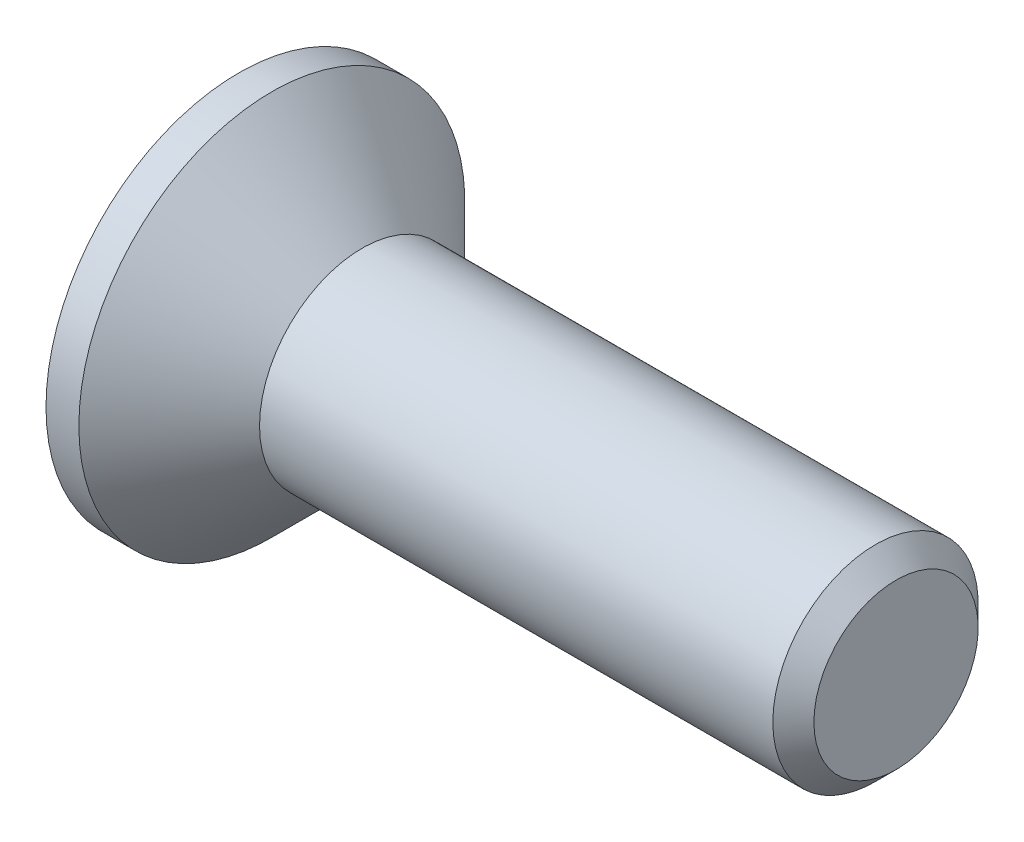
ISO-10303-21;
HEADER;
FILE_DESCRIPTION(('STEP AP214'),'2;1');
FILE_NAME('part.step','',(''),(''),'','','');
FILE_SCHEMA(('AUTOMOTIVE_DESIGN { 1 0 10303 214 1 1 1 1 }'));
ENDSEC;
DATA;
#1=APPLICATION_CONTEXT('core data for automotive mechanical design processes');
#2=APPLICATION_PROTOCOL_DEFINITION('international standard','automotive_design',2000,#1);
#3=PRODUCT_CONTEXT('',#1,'mechanical');
#4=PRODUCT('Part','Part','',(#3));
#5=PRODUCT_RELATED_PRODUCT_CATEGORY('part','',(#4));
#6=PRODUCT_DEFINITION_FORMATION('','',#4);
#7=PRODUCT_DEFINITION_CONTEXT('part definition',#1,'design');
#8=PRODUCT_DEFINITION('design','',#6,#7);
#9=PRODUCT_DEFINITION_SHAPE('','',#8);
#10=(LENGTH_UNIT() NAMED_UNIT(*) SI_UNIT(.MILLI.,.METRE.));
#11=(NAMED_UNIT(*) PLANE_ANGLE_UNIT() SI_UNIT($,.RADIAN.));
#12=(NAMED_UNIT(*) SI_UNIT($,.STERADIAN.) SOLID_ANGLE_UNIT());
#13=UNCERTAINTY_MEASURE_WITH_UNIT(LENGTH_MEASURE(1.E-05),#10,'distance_accuracy_value','');
#14=(GEOMETRIC_REPRESENTATION_CONTEXT(3) GLOBAL_UNCERTAINTY_ASSIGNED_CONTEXT((#13)) GLOBAL_UNIT_ASSIGNED_CONTEXT((#10,
#11,#12)) REPRESENTATION_CONTEXT('',''));
#15=CARTESIAN_POINT('',(0.,0.,0.));
#16=DIRECTION('',(0.,0.,1.));
#17=DIRECTION('',(1.,0.,0.));
#18=AXIS2_PLACEMENT_3D('',#15,#16,#17);
#19=CARTESIAN_POINT('',(0.,0.,0.));
#20=DIRECTION('',(-1.,0.,0.));
#21=DIRECTION('',(0.,0.,1.));
#22=AXIS2_PLACEMENT_3D('',#19,#20,#21);
#23=CONICAL_SURFACE('',#22,1.25,0.78539816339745);
#24=CARTESIAN_POINT('',(-1.1,0.,0.));
#25=DIRECTION('',(-1.,0.,0.));
#26=DIRECTION('',(0.,0.,1.));
#27=AXIS2_PLACEMENT_3D('',#24,#25,#26);
#28=CIRCLE('',#27,2.35);
#29=CARTESIAN_POINT('',(-1.1,0.,2.35));
#30=VERTEX_POINT('',#29);
#31=EDGE_CURVE('E189',#30,#30,#28,.T.);
#32=ORIENTED_EDGE('',*,*,#31,.F.);
#33=EDGE_LOOP('',(#32));
#34=FACE_BOUND('',#33,.T.);
#35=CARTESIAN_POINT('',(0.,0.,0.));
#36=DIRECTION('',(-1.,0.,0.));
#37=DIRECTION('',(0.,0.,1.));
#38=AXIS2_PLACEMENT_3D('',#35,#36,#37);
#39=CIRCLE('',#38,1.25);
#40=CARTESIAN_POINT('',(0.,0.,1.25));
#41=VERTEX_POINT('',#40);
#42=EDGE_CURVE('E212',#41,#41,#39,.T.);
#43=ORIENTED_EDGE('',*,*,#42,.T.);
#44=EDGE_LOOP('',(#43));
#45=FACE_BOUND('',#44,.T.);
#46=ADVANCED_FACE('F33',(#34,#45),#23,.T.);
#47=CARTESIAN_POINT('',(-1.5,0.,0.));
#48=DIRECTION('',(-1.,0.,0.));
#49=DIRECTION('',(0.,0.,1.));
#50=AXIS2_PLACEMENT_3D('',#47,#48,#49);
#51=CYLINDRICAL_SURFACE('',#50,1.25);
#52=CARTESIAN_POINT('',(6.25,0.,0.));
#53=DIRECTION('',(-1.,0.,0.));
#54=DIRECTION('',(0.,0.,1.));
#55=AXIS2_PLACEMENT_3D('',#52,#53,#54);
#56=CIRCLE('',#55,1.25);
#57=CARTESIAN_POINT('',(6.25,0.,1.25));
#58=VERTEX_POINT('',#57);
#59=EDGE_CURVE('E41',#58,#58,#56,.T.);
#60=ORIENTED_EDGE('',*,*,#59,.T.);
#61=EDGE_LOOP('',(#60));
#62=FACE_BOUND('',#61,.T.);
#63=ORIENTED_EDGE('',*,*,#42,.F.);
#64=EDGE_LOOP('',(#63));
#65=FACE_BOUND('',#64,.T.);
#66=ADVANCED_FACE('F217',(#62,#65),#51,.T.);
#67=CARTESIAN_POINT('',(6.5,0.,0.));
#68=DIRECTION('',(-1.,0.,0.));
#69=DIRECTION('',(0.,0.,1.));
#70=AXIS2_PLACEMENT_3D('',#67,#68,#69);
#71=PLANE('',#70);
#72=CARTESIAN_POINT('',(6.5,0.,0.));
#73=DIRECTION('',(-1.,0.,0.));
#74=DIRECTION('',(0.,0.,1.));
#75=AXIS2_PLACEMENT_3D('',#72,#73,#74);
#76=CIRCLE('',#75,0.999999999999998);
#77=CARTESIAN_POINT('',(6.5,0.,0.999999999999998));
#78=VERTEX_POINT('',#77);
#79=EDGE_CURVE('E11',#78,#78,#76,.F.);
#80=ORIENTED_EDGE('',*,*,#79,.T.);
#81=EDGE_LOOP('',(#80));
#82=FACE_BOUND('',#81,.T.);
#83=ADVANCED_FACE('F239',(#82),#71,.F.);
#84=CARTESIAN_POINT('',(-1.5,2.35,0.));
#85=DIRECTION('',(1.,0.,0.));
#86=DIRECTION('',(0.,0.,-1.));
#87=AXIS2_PLACEMENT_3D('',#84,#85,#86);
#88=PLANE('',#87);
#89=DIRECTION('',(0.,0.,-1.));
#90=VECTOR('',#89,1.);
#91=CARTESIAN_POINT('',(-1.5,0.34,-1.35));
#92=LINE('',#91,#90);
#93=CARTESIAN_POINT('',(-1.5,0.34,-0.34));
#94=VERTEX_POINT('',#93);
#95=CARTESIAN_POINT('',(-1.5,0.34,-1.35));
#96=VERTEX_POINT('',#95);
#97=EDGE_CURVE('E158',#94,#96,#92,.T.);
#98=ORIENTED_EDGE('',*,*,#97,.F.);
#99=DIRECTION('',(0.,-1.,0.));
#100=VECTOR('',#99,1.);
#101=CARTESIAN_POINT('',(-1.5,0.34,-0.34));
#102=LINE('',#101,#100);
#103=CARTESIAN_POINT('',(-1.5,1.35,-0.34));
#104=VERTEX_POINT('',#103);
#105=EDGE_CURVE('E48',#104,#94,#102,.T.);
#106=ORIENTED_EDGE('',*,*,#105,.F.);
#107=DIRECTION('',(0.,0.,-1.));
#108=VECTOR('',#107,1.);
#109=CARTESIAN_POINT('',(-1.5,1.35,-0.34));
#110=LINE('',#109,#108);
#111=CARTESIAN_POINT('',(-1.5,1.35,0.34));
#112=VERTEX_POINT('',#111);
#113=EDGE_CURVE('E185',#112,#104,#110,.T.);
#114=ORIENTED_EDGE('',*,*,#113,.F.);
#115=DIRECTION('',(0.,1.,0.));
#116=VECTOR('',#115,1.);
#117=CARTESIAN_POINT('',(-1.5,1.35,0.34));
#118=LINE('',#117,#116);
#119=CARTESIAN_POINT('',(-1.5,0.34,0.34));
#120=VERTEX_POINT('',#119);
#121=EDGE_CURVE('E183',#120,#112,#118,.T.);
#122=ORIENTED_EDGE('',*,*,#121,.F.);
#123=DIRECTION('',(0.,0.,-1.));
#124=VECTOR('',#123,1.);
#125=CARTESIAN_POINT('',(-1.5,0.34,0.34));
#126=LINE('',#125,#124);
#127=CARTESIAN_POINT('',(-1.5,0.34,1.35));
#128=VERTEX_POINT('',#127);
#129=EDGE_CURVE('E132',#128,#120,#126,.T.);
#130=ORIENTED_EDGE('',*,*,#129,.F.);
#131=DIRECTION('',(0.,1.,0.));
#132=VECTOR('',#131,1.);
#133=CARTESIAN_POINT('',(-1.5,0.34,1.35));
#134=LINE('',#133,#132);
#135=CARTESIAN_POINT('',(-1.5,-0.34,1.35));
#136=VERTEX_POINT('',#135);
#137=EDGE_CURVE('E179',#136,#128,#134,.T.);
#138=ORIENTED_EDGE('',*,*,#137,.F.);
#139=DIRECTION('',(0.,0.,1.));
#140=VECTOR('',#139,1.);
#141=CARTESIAN_POINT('',(-1.5,-0.34,1.35));
#142=LINE('',#141,#140);
#143=CARTESIAN_POINT('',(-1.5,-0.34,0.34));
#144=VERTEX_POINT('',#143);
#145=EDGE_CURVE('E176',#144,#136,#142,.T.);
#146=ORIENTED_EDGE('',*,*,#145,.F.);
#147=DIRECTION('',(0.,1.,0.));
#148=VECTOR('',#147,1.);
#149=CARTESIAN_POINT('',(-1.5,-0.34,0.34));
#150=LINE('',#149,#148);
#151=CARTESIAN_POINT('',(-1.5,-1.35,0.34));
#152=VERTEX_POINT('',#151);
#153=EDGE_CURVE('E173',#152,#144,#150,.T.);
#154=ORIENTED_EDGE('',*,*,#153,.F.);
#155=DIRECTION('',(0.,0.,1.));
#156=VECTOR('',#155,1.);
#157=CARTESIAN_POINT('',(-1.5,-1.35,0.34));
#158=LINE('',#157,#156);
#159=CARTESIAN_POINT('',(-1.5,-1.35,-0.34));
#160=VERTEX_POINT('',#159);
#161=EDGE_CURVE('E170',#160,#152,#158,.T.);
#162=ORIENTED_EDGE('',*,*,#161,.F.);
#163=DIRECTION('',(0.,-1.,0.));
#164=VECTOR('',#163,1.);
#165=CARTESIAN_POINT('',(-1.5,-1.35,-0.34));
#166=LINE('',#165,#164);
#167=CARTESIAN_POINT('',(-1.5,-0.34,-0.34));
#168=VERTEX_POINT('',#167);
#169=EDGE_CURVE('E167',#168,#160,#166,.T.);
#170=ORIENTED_EDGE('',*,*,#169,.F.);
#171=DIRECTION('',(0.,0.,1.));
#172=VECTOR('',#171,1.);
#173=CARTESIAN_POINT('',(-1.5,-0.34,-0.34));
#174=LINE('',#173,#172);
#175=CARTESIAN_POINT('',(-1.5,-0.34,-1.35));
#176=VERTEX_POINT('',#175);
#177=EDGE_CURVE('E164',#176,#168,#174,.T.);
#178=ORIENTED_EDGE('',*,*,#177,.F.);
#179=DIRECTION('',(0.,-1.,0.));
#180=VECTOR('',#179,1.);
#181=CARTESIAN_POINT('',(-1.5,-0.34,-1.35));
#182=LINE('',#181,#180);
#183=EDGE_CURVE('E161',#96,#176,#182,.T.);
#184=ORIENTED_EDGE('',*,*,#183,.F.);
#185=EDGE_LOOP('',(#98,#106,#114,#122,#130,#138,#146,#154,#162,#170,#178,#184));
#186=FACE_BOUND('',#185,.T.);
#187=CARTESIAN_POINT('',(-1.5,0.,0.));
#188=DIRECTION('',(-1.,0.,0.));
#189=DIRECTION('',(0.,0.,1.));
#190=AXIS2_PLACEMENT_3D('',#187,#188,#189);
#191=CIRCLE('',#190,2.35);
#192=CARTESIAN_POINT('',(-1.5,0.,2.35));
#193=VERTEX_POINT('',#192);
#194=EDGE_CURVE('E209',#193,#193,#191,.T.);
#195=ORIENTED_EDGE('',*,*,#194,.T.);
#196=EDGE_LOOP('',(#195));
#197=FACE_BOUND('',#196,.T.);
#198=ADVANCED_FACE('F230',(#186,#197),#88,.F.);
#199=CARTESIAN_POINT('',(-1.5,0.,0.));
#200=DIRECTION('',(-1.,0.,0.));
#201=DIRECTION('',(0.,0.,1.));
#202=AXIS2_PLACEMENT_3D('',#199,#200,#201);
#203=CYLINDRICAL_SURFACE('',#202,2.35);
#204=ORIENTED_EDGE('',*,*,#194,.F.);
#205=EDGE_LOOP('',(#204));
#206=FACE_BOUND('',#205,.T.);
#207=ORIENTED_EDGE('',*,*,#31,.T.);
#208=EDGE_LOOP('',(#207));
#209=FACE_BOUND('',#208,.T.);
#210=ADVANCED_FACE('F222',(#206,#209),#203,.T.);
#211=CARTESIAN_POINT('',(6.25,0.,0.));
#212=DIRECTION('',(-1.,0.,0.));
#213=DIRECTION('',(0.,0.,1.));
#214=AXIS2_PLACEMENT_3D('',#211,#212,#213);
#215=CONICAL_SURFACE('',#214,1.25,0.785398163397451);
#216=ORIENTED_EDGE('',*,*,#79,.F.);
#217=EDGE_LOOP('',(#216));
#218=FACE_BOUND('',#217,.T.);
#219=ORIENTED_EDGE('',*,*,#59,.F.);
#220=EDGE_LOOP('',(#219));
#221=FACE_BOUND('',#220,.T.);
#222=ADVANCED_FACE('F35',(#218,#221),#215,.T.);
#223=CARTESIAN_POINT('',(-0.25,0.34,-0.34));
#224=DIRECTION('',(0.,0.,-1.));
#225=DIRECTION('',(-1.,0.,0.));
#226=AXIS2_PLACEMENT_3D('',#223,#224,#225);
#227=PLANE('',#226);
#228=ORIENTED_EDGE('',*,*,#105,.T.);
#229=DIRECTION('',(-1.,0.,0.));
#230=VECTOR('',#229,1.);
#231=CARTESIAN_POINT('',(-0.25,0.34,-0.34));
#232=LINE('',#231,#230);
#233=CARTESIAN_POINT('',(-0.25,0.34,-0.34));
#234=VERTEX_POINT('',#233);
#235=EDGE_CURVE('E96',#234,#94,#232,.T.);
#236=ORIENTED_EDGE('',*,*,#235,.F.);
#237=DIRECTION('',(0.,-1.,0.));
#238=VECTOR('',#237,1.);
#239=CARTESIAN_POINT('',(-0.25,0.34,-0.34));
#240=LINE('',#239,#238);
#241=CARTESIAN_POINT('',(-0.25,1.35,-0.34));
#242=VERTEX_POINT('',#241);
#243=EDGE_CURVE('E187',#242,#234,#240,.T.);
#244=ORIENTED_EDGE('',*,*,#243,.F.);
#245=DIRECTION('',(-1.,0.,0.));
#246=VECTOR('',#245,1.);
#247=CARTESIAN_POINT('',(-0.25,1.35,-0.34));
#248=LINE('',#247,#246);
#249=EDGE_CURVE('E56',#242,#104,#248,.T.);
#250=ORIENTED_EDGE('',*,*,#249,.T.);
#251=EDGE_LOOP('',(#228,#236,#244,#250));
#252=FACE_BOUND('',#251,.T.);
#253=ADVANCED_FACE('F221',(#252),#227,.F.);
#254=CARTESIAN_POINT('',(-0.25,1.35,-0.34));
#255=DIRECTION('',(0.,1.,0.));
#256=DIRECTION('',(-1.,0.,0.));
#257=AXIS2_PLACEMENT_3D('',#254,#255,#256);
#258=PLANE('',#257);
#259=ORIENTED_EDGE('',*,*,#113,.T.);
#260=ORIENTED_EDGE('',*,*,#249,.F.);
#261=DIRECTION('',(0.,0.,-1.));
#262=VECTOR('',#261,1.);
#263=CARTESIAN_POINT('',(-0.25,1.35,-0.34));
#264=LINE('',#263,#262);
#265=CARTESIAN_POINT('',(-0.25,1.35,0.34));
#266=VERTEX_POINT('',#265);
#267=EDGE_CURVE('E144',#266,#242,#264,.T.);
#268=ORIENTED_EDGE('',*,*,#267,.F.);
#269=DIRECTION('',(-1.,0.,0.));
#270=VECTOR('',#269,1.);
#271=CARTESIAN_POINT('',(-0.25,1.35,0.34));
#272=LINE('',#271,#270);
#273=EDGE_CURVE('E136',#266,#112,#272,.T.);
#274=ORIENTED_EDGE('',*,*,#273,.T.);
#275=EDGE_LOOP('',(#259,#260,#268,#274));
#276=FACE_BOUND('',#275,.T.);
#277=ADVANCED_FACE('F228',(#276),#258,.F.);
#278=CARTESIAN_POINT('',(-0.25,1.35,0.34));
#279=DIRECTION('',(0.,0.,1.));
#280=DIRECTION('',(1.,0.,0.));
#281=AXIS2_PLACEMENT_3D('',#278,#279,#280);
#282=PLANE('',#281);
#283=ORIENTED_EDGE('',*,*,#121,.T.);
#284=ORIENTED_EDGE('',*,*,#273,.F.);
#285=DIRECTION('',(0.,1.,0.));
#286=VECTOR('',#285,1.);
#287=CARTESIAN_POINT('',(-0.25,1.35,0.34));
#288=LINE('',#287,#286);
#289=CARTESIAN_POINT('',(-0.25,0.34,0.34));
#290=VERTEX_POINT('',#289);
#291=EDGE_CURVE('E140',#290,#266,#288,.T.);
#292=ORIENTED_EDGE('',*,*,#291,.F.);
#293=DIRECTION('',(-1.,0.,0.));
#294=VECTOR('',#293,1.);
#295=CARTESIAN_POINT('',(-0.25,0.34,0.34));
#296=LINE('',#295,#294);
#297=EDGE_CURVE('E125',#290,#120,#296,.T.);
#298=ORIENTED_EDGE('',*,*,#297,.T.);
#299=EDGE_LOOP('',(#283,#284,#292,#298));
#300=FACE_BOUND('',#299,.T.);
#301=ADVANCED_FACE('F141',(#300),#282,.F.);
#302=CARTESIAN_POINT('',(-0.25,0.34,0.34));
#303=DIRECTION('',(0.,1.,0.));
#304=DIRECTION('',(-1.,0.,0.));
#305=AXIS2_PLACEMENT_3D('',#302,#303,#304);
#306=PLANE('',#305);
#307=ORIENTED_EDGE('',*,*,#129,.T.);
#308=ORIENTED_EDGE('',*,*,#297,.F.);
#309=DIRECTION('',(0.,0.,-1.));
#310=VECTOR('',#309,1.);
#311=CARTESIAN_POINT('',(-0.25,0.34,0.34));
#312=LINE('',#311,#310);
#313=CARTESIAN_POINT('',(-0.25,0.34,1.35));
#314=VERTEX_POINT('',#313);
#315=EDGE_CURVE('E129',#314,#290,#312,.T.);
#316=ORIENTED_EDGE('',*,*,#315,.F.);
#317=DIRECTION('',(-1.,0.,0.));
#318=VECTOR('',#317,1.);
#319=CARTESIAN_POINT('',(-0.25,0.34,1.35));
#320=LINE('',#319,#318);
#321=EDGE_CURVE('E137',#314,#128,#320,.T.);
#322=ORIENTED_EDGE('',*,*,#321,.T.);
#323=EDGE_LOOP('',(#307,#308,#316,#322));
#324=FACE_BOUND('',#323,.T.);
#325=ADVANCED_FACE('F127',(#324),#306,.F.);
#326=CARTESIAN_POINT('',(-0.25,0.34,1.35));
#327=DIRECTION('',(0.,0.,1.));
#328=DIRECTION('',(1.,0.,0.));
#329=AXIS2_PLACEMENT_3D('',#326,#327,#328);
#330=PLANE('',#329);
#331=ORIENTED_EDGE('',*,*,#137,.T.);
#332=ORIENTED_EDGE('',*,*,#321,.F.);
#333=DIRECTION('',(0.,1.,0.));
#334=VECTOR('',#333,1.);
#335=CARTESIAN_POINT('',(-0.25,0.34,1.35));
#336=LINE('',#335,#334);
#337=CARTESIAN_POINT('',(-0.25,-0.34,1.35));
#338=VERTEX_POINT('',#337);
#339=EDGE_CURVE('E150',#338,#314,#336,.T.);
#340=ORIENTED_EDGE('',*,*,#339,.F.);
#341=DIRECTION('',(-1.,0.,0.));
#342=VECTOR('',#341,1.);
#343=CARTESIAN_POINT('',(-0.25,-0.34,1.35));
#344=LINE('',#343,#342);
#345=EDGE_CURVE('E192',#338,#136,#344,.T.);
#346=ORIENTED_EDGE('',*,*,#345,.T.);
#347=EDGE_LOOP('',(#331,#332,#340,#346));
#348=FACE_BOUND('',#347,.T.);
#349=ADVANCED_FACE('F277',(#348),#330,.F.);
#350=CARTESIAN_POINT('',(-0.25,-0.34,1.35));
#351=DIRECTION('',(0.,-1.,0.));
#352=DIRECTION('',(1.,0.,0.));
#353=AXIS2_PLACEMENT_3D('',#350,#351,#352);
#354=PLANE('',#353);
#355=ORIENTED_EDGE('',*,*,#145,.T.);
#356=ORIENTED_EDGE('',*,*,#345,.F.);
#357=DIRECTION('',(0.,0.,1.));
#358=VECTOR('',#357,1.);
#359=CARTESIAN_POINT('',(-0.25,-0.34,1.35));
#360=LINE('',#359,#358);
#361=CARTESIAN_POINT('',(-0.25,-0.34,0.34));
#362=VERTEX_POINT('',#361);
#363=EDGE_CURVE('E152',#362,#338,#360,.T.);
#364=ORIENTED_EDGE('',*,*,#363,.F.);
#365=DIRECTION('',(-1.,0.,0.));
#366=VECTOR('',#365,1.);
#367=CARTESIAN_POINT('',(-0.25,-0.34,0.34));
#368=LINE('',#367,#366);
#369=EDGE_CURVE('E194',#362,#144,#368,.T.);
#370=ORIENTED_EDGE('',*,*,#369,.T.);
#371=EDGE_LOOP('',(#355,#356,#364,#370));
#372=FACE_BOUND('',#371,.T.);
#373=ADVANCED_FACE('F273',(#372),#354,.F.);
#374=CARTESIAN_POINT('',(-0.25,-0.34,0.34));
#375=DIRECTION('',(0.,0.,1.));
#376=DIRECTION('',(1.,0.,0.));
#377=AXIS2_PLACEMENT_3D('',#374,#375,#376);
#378=PLANE('',#377);
#379=ORIENTED_EDGE('',*,*,#153,.T.);
#380=ORIENTED_EDGE('',*,*,#369,.F.);
#381=DIRECTION('',(0.,1.,0.));
#382=VECTOR('',#381,1.);
#383=CARTESIAN_POINT('',(-0.25,-0.34,0.34));
#384=LINE('',#383,#382);
#385=CARTESIAN_POINT('',(-0.25,-1.35,0.34));
#386=VERTEX_POINT('',#385);
#387=EDGE_CURVE('E422',#386,#362,#384,.T.);
#388=ORIENTED_EDGE('',*,*,#387,.F.);
#389=DIRECTION('',(-1.,0.,0.));
#390=VECTOR('',#389,1.);
#391=CARTESIAN_POINT('',(-0.25,-1.35,0.34));
#392=LINE('',#391,#390);
#393=EDGE_CURVE('E196',#386,#152,#392,.T.);
#394=ORIENTED_EDGE('',*,*,#393,.T.);
#395=EDGE_LOOP('',(#379,#380,#388,#394));
#396=FACE_BOUND('',#395,.T.);
#397=ADVANCED_FACE('F269',(#396),#378,.F.);
#398=CARTESIAN_POINT('',(-0.25,-1.35,0.34));
#399=DIRECTION('',(0.,-1.,0.));
#400=DIRECTION('',(1.,0.,0.));
#401=AXIS2_PLACEMENT_3D('',#398,#399,#400);
#402=PLANE('',#401);
#403=ORIENTED_EDGE('',*,*,#161,.T.);
#404=ORIENTED_EDGE('',*,*,#393,.F.);
#405=DIRECTION('',(0.,0.,1.));
#406=VECTOR('',#405,1.);
#407=CARTESIAN_POINT('',(-0.25,-1.35,0.34));
#408=LINE('',#407,#406);
#409=CARTESIAN_POINT('',(-0.25,-1.35,-0.34));
#410=VERTEX_POINT('',#409);
#411=EDGE_CURVE('E419',#410,#386,#408,.T.);
#412=ORIENTED_EDGE('',*,*,#411,.F.);
#413=DIRECTION('',(-1.,0.,0.));
#414=VECTOR('',#413,1.);
#415=CARTESIAN_POINT('',(-0.25,-1.35,-0.34));
#416=LINE('',#415,#414);
#417=EDGE_CURVE('E198',#410,#160,#416,.T.);
#418=ORIENTED_EDGE('',*,*,#417,.T.);
#419=EDGE_LOOP('',(#403,#404,#412,#418));
#420=FACE_BOUND('',#419,.T.);
#421=ADVANCED_FACE('F265',(#420),#402,.F.);
#422=CARTESIAN_POINT('',(-0.25,-1.35,-0.34));
#423=DIRECTION('',(0.,0.,-1.));
#424=DIRECTION('',(-1.,0.,0.));
#425=AXIS2_PLACEMENT_3D('',#422,#423,#424);
#426=PLANE('',#425);
#427=ORIENTED_EDGE('',*,*,#169,.T.);
#428=ORIENTED_EDGE('',*,*,#417,.F.);
#429=DIRECTION('',(0.,-1.,0.));
#430=VECTOR('',#429,1.);
#431=CARTESIAN_POINT('',(-0.25,-1.35,-0.34));
#432=LINE('',#431,#430);
#433=CARTESIAN_POINT('',(-0.25,-0.34,-0.34));
#434=VERTEX_POINT('',#433);
#435=EDGE_CURVE('E416',#434,#410,#432,.T.);
#436=ORIENTED_EDGE('',*,*,#435,.F.);
#437=DIRECTION('',(-1.,0.,0.));
#438=VECTOR('',#437,1.);
#439=CARTESIAN_POINT('',(-0.25,-0.34,-0.34));
#440=LINE('',#439,#438);
#441=EDGE_CURVE('E200',#434,#168,#440,.T.);
#442=ORIENTED_EDGE('',*,*,#441,.T.);
#443=EDGE_LOOP('',(#427,#428,#436,#442));
#444=FACE_BOUND('',#443,.T.);
#445=ADVANCED_FACE('F261',(#444),#426,.F.);
#446=CARTESIAN_POINT('',(-0.25,-0.34,-0.34));
#447=DIRECTION('',(0.,-1.,0.));
#448=DIRECTION('',(1.,0.,0.));
#449=AXIS2_PLACEMENT_3D('',#446,#447,#448);
#450=PLANE('',#449);
#451=ORIENTED_EDGE('',*,*,#177,.T.);
#452=ORIENTED_EDGE('',*,*,#441,.F.);
#453=DIRECTION('',(0.,0.,1.));
#454=VECTOR('',#453,1.);
#455=CARTESIAN_POINT('',(-0.25,-0.34,-0.34));
#456=LINE('',#455,#454);
#457=CARTESIAN_POINT('',(-0.25,-0.34,-1.35));
#458=VERTEX_POINT('',#457);
#459=EDGE_CURVE('E413',#458,#434,#456,.T.);
#460=ORIENTED_EDGE('',*,*,#459,.F.);
#461=DIRECTION('',(-1.,0.,0.));
#462=VECTOR('',#461,1.);
#463=CARTESIAN_POINT('',(-0.25,-0.34,-1.35));
#464=LINE('',#463,#462);
#465=EDGE_CURVE('E202',#458,#176,#464,.T.);
#466=ORIENTED_EDGE('',*,*,#465,.T.);
#467=EDGE_LOOP('',(#451,#452,#460,#466));
#468=FACE_BOUND('',#467,.T.);
#469=ADVANCED_FACE('F257',(#468),#450,.F.);
#470=CARTESIAN_POINT('',(-0.25,-0.34,-1.35));
#471=DIRECTION('',(0.,0.,-1.));
#472=DIRECTION('',(-1.,0.,0.));
#473=AXIS2_PLACEMENT_3D('',#470,#471,#472);
#474=PLANE('',#473);
#475=ORIENTED_EDGE('',*,*,#183,.T.);
#476=ORIENTED_EDGE('',*,*,#465,.F.);
#477=DIRECTION('',(0.,-1.,0.));
#478=VECTOR('',#477,1.);
#479=CARTESIAN_POINT('',(-0.25,-0.34,-1.35));
#480=LINE('',#479,#478);
#481=CARTESIAN_POINT('',(-0.25,0.34,-1.35));
#482=VERTEX_POINT('',#481);
#483=EDGE_CURVE('E408',#482,#458,#480,.T.);
#484=ORIENTED_EDGE('',*,*,#483,.F.);
#485=DIRECTION('',(-1.,0.,0.));
#486=VECTOR('',#485,1.);
#487=CARTESIAN_POINT('',(-0.25,0.34,-1.35));
#488=LINE('',#487,#486);
#489=EDGE_CURVE('E204',#482,#96,#488,.T.);
#490=ORIENTED_EDGE('',*,*,#489,.T.);
#491=EDGE_LOOP('',(#475,#476,#484,#490));
#492=FACE_BOUND('',#491,.T.);
#493=ADVANCED_FACE('F253',(#492),#474,.F.);
#494=CARTESIAN_POINT('',(-0.25,0.34,-1.35));
#495=DIRECTION('',(0.,1.,0.));
#496=DIRECTION('',(-1.,0.,0.));
#497=AXIS2_PLACEMENT_3D('',#494,#495,#496);
#498=PLANE('',#497);
#499=ORIENTED_EDGE('',*,*,#97,.T.);
#500=ORIENTED_EDGE('',*,*,#489,.F.);
#501=DIRECTION('',(0.,0.,-1.));
#502=VECTOR('',#501,1.);
#503=CARTESIAN_POINT('',(-0.25,0.34,-1.35));
#504=LINE('',#503,#502);
#505=EDGE_CURVE('E406',#234,#482,#504,.T.);
#506=ORIENTED_EDGE('',*,*,#505,.F.);
#507=ORIENTED_EDGE('',*,*,#235,.T.);
#508=EDGE_LOOP('',(#499,#500,#506,#507));
#509=FACE_BOUND('',#508,.T.);
#510=ADVANCED_FACE('F250',(#509),#498,.F.);
#511=CARTESIAN_POINT('',(-0.25,0.,0.));
#512=DIRECTION('',(1.,0.,0.));
#513=DIRECTION('',(0.,0.,-1.));
#514=AXIS2_PLACEMENT_3D('',#511,#512,#513);
#515=PLANE('',#514);
#516=ORIENTED_EDGE('',*,*,#243,.T.);
#517=ORIENTED_EDGE('',*,*,#505,.T.);
#518=ORIENTED_EDGE('',*,*,#483,.T.);
#519=ORIENTED_EDGE('',*,*,#459,.T.);
#520=ORIENTED_EDGE('',*,*,#435,.T.);
#521=ORIENTED_EDGE('',*,*,#411,.T.);
#522=ORIENTED_EDGE('',*,*,#387,.T.);
#523=ORIENTED_EDGE('',*,*,#363,.T.);
#524=ORIENTED_EDGE('',*,*,#339,.T.);
#525=ORIENTED_EDGE('',*,*,#315,.T.);
#526=ORIENTED_EDGE('',*,*,#291,.T.);
#527=ORIENTED_EDGE('',*,*,#267,.T.);
#528=EDGE_LOOP('',(#516,#517,#518,#519,#520,#521,#522,#523,#524,#525,#526,#527));
#529=FACE_BOUND('',#528,.T.);
#530=ADVANCED_FACE('F147',(#529),#515,.F.);
#531=CLOSED_SHELL('',(#46,#66,#83,#198,#210,#222,#253,#277,#301,#325,#349,#373,#397,#421,#445,
#469,#493,#510,#530));
#532=MANIFOLD_SOLID_BREP('B2',#531);
#533=ADVANCED_BREP_SHAPE_REPRESENTATION('',(#18,#532),#14);
#534=SHAPE_DEFINITION_REPRESENTATION(#9,#533);
ENDSEC;
END-ISO-10303-21;
